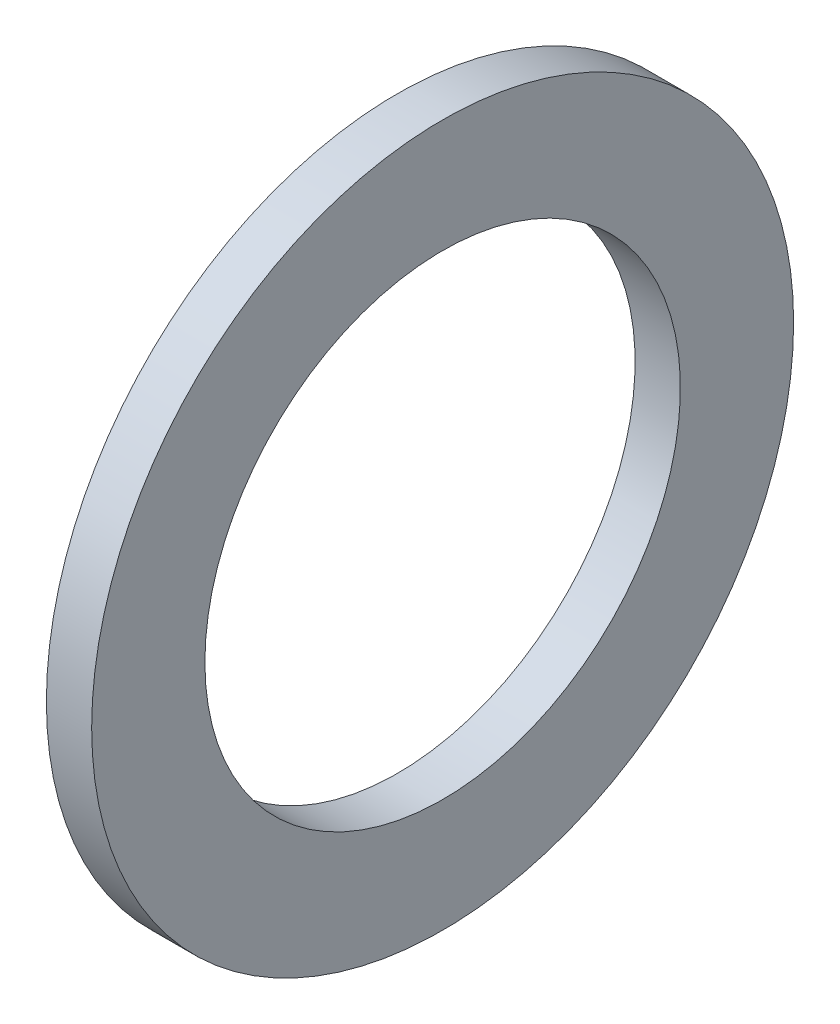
ISO-10303-21;
HEADER;
FILE_DESCRIPTION(('STEP AP214'),'2;1');
FILE_NAME('part.step','',(''),(''),'','','');
FILE_SCHEMA(('AUTOMOTIVE_DESIGN { 1 0 10303 214 1 1 1 1 }'));
ENDSEC;
DATA;
#1=APPLICATION_CONTEXT('core data for automotive mechanical design processes');
#2=APPLICATION_PROTOCOL_DEFINITION('international standard','automotive_design',2000,#1);
#3=PRODUCT_CONTEXT('',#1,'mechanical');
#4=PRODUCT('Part','Part','',(#3));
#5=PRODUCT_RELATED_PRODUCT_CATEGORY('part','',(#4));
#6=PRODUCT_DEFINITION_FORMATION('','',#4);
#7=PRODUCT_DEFINITION_CONTEXT('part definition',#1,'design');
#8=PRODUCT_DEFINITION('design','',#6,#7);
#9=PRODUCT_DEFINITION_SHAPE('','',#8);
#10=(LENGTH_UNIT() NAMED_UNIT(*) SI_UNIT(.MILLI.,.METRE.));
#11=(NAMED_UNIT(*) PLANE_ANGLE_UNIT() SI_UNIT($,.RADIAN.));
#12=(NAMED_UNIT(*) SI_UNIT($,.STERADIAN.) SOLID_ANGLE_UNIT());
#13=UNCERTAINTY_MEASURE_WITH_UNIT(LENGTH_MEASURE(1.E-05),#10,'distance_accuracy_value','');
#14=(GEOMETRIC_REPRESENTATION_CONTEXT(3) GLOBAL_UNCERTAINTY_ASSIGNED_CONTEXT((#13)) GLOBAL_UNIT_ASSIGNED_CONTEXT((#10,
#11,#12)) REPRESENTATION_CONTEXT('',''));
#15=CARTESIAN_POINT('',(0.,0.,0.));
#16=DIRECTION('',(0.,0.,1.));
#17=DIRECTION('',(1.,0.,0.));
#18=AXIS2_PLACEMENT_3D('',#15,#16,#17);
#19=CARTESIAN_POINT('',(-34.9249999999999,0.,0.));
#20=DIRECTION('',(-1.,0.,0.));
#21=DIRECTION('',(0.,0.,1.));
#22=AXIS2_PLACEMENT_3D('',#19,#20,#21);
#23=CYLINDRICAL_SURFACE('',#22,10.5);
#24=CARTESIAN_POINT('',(0.,0.,0.));
#25=DIRECTION('',(-1.,0.,0.));
#26=DIRECTION('',(0.,0.,1.));
#27=AXIS2_PLACEMENT_3D('',#24,#25,#26);
#28=CIRCLE('',#27,10.5);
#29=CARTESIAN_POINT('',(0.,0.,10.5));
#30=VERTEX_POINT('',#29);
#31=EDGE_CURVE('E10',#30,#30,#28,.T.);
#32=ORIENTED_EDGE('',*,*,#31,.F.);
#33=EDGE_LOOP('',(#32));
#34=FACE_BOUND('',#33,.T.);
#35=CARTESIAN_POINT('',(-2.,0.,0.));
#36=DIRECTION('',(-1.,0.,0.));
#37=DIRECTION('',(0.,0.,1.));
#38=AXIS2_PLACEMENT_3D('',#35,#36,#37);
#39=CIRCLE('',#38,10.5);
#40=CARTESIAN_POINT('',(-2.,0.,10.5));
#41=VERTEX_POINT('',#40);
#42=EDGE_CURVE('E51',#41,#41,#39,.T.);
#43=ORIENTED_EDGE('',*,*,#42,.T.);
#44=EDGE_LOOP('',(#43));
#45=FACE_BOUND('',#44,.T.);
#46=ADVANCED_FACE('F37',(#34,#45),#23,.F.);
#47=CARTESIAN_POINT('',(0.,10.5,0.));
#48=DIRECTION('',(-1.,0.,0.));
#49=DIRECTION('',(0.,0.,1.));
#50=AXIS2_PLACEMENT_3D('',#47,#48,#49);
#51=PLANE('',#50);
#52=CARTESIAN_POINT('',(0.,0.,0.));
#53=DIRECTION('',(-1.,0.,0.));
#54=DIRECTION('',(0.,0.,1.));
#55=AXIS2_PLACEMENT_3D('',#52,#53,#54);
#56=CIRCLE('',#55,15.5);
#57=CARTESIAN_POINT('',(0.,0.,15.5));
#58=VERTEX_POINT('',#57);
#59=EDGE_CURVE('E43',#58,#58,#56,.T.);
#60=ORIENTED_EDGE('',*,*,#59,.F.);
#61=EDGE_LOOP('',(#60));
#62=FACE_BOUND('',#61,.T.);
#63=ORIENTED_EDGE('',*,*,#31,.T.);
#64=EDGE_LOOP('',(#63));
#65=FACE_BOUND('',#64,.T.);
#66=ADVANCED_FACE('F66',(#62,#65),#51,.F.);
#67=CARTESIAN_POINT('',(-34.9249999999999,0.,0.));
#68=DIRECTION('',(-1.,0.,0.));
#69=DIRECTION('',(0.,0.,1.));
#70=AXIS2_PLACEMENT_3D('',#67,#68,#69);
#71=CYLINDRICAL_SURFACE('',#70,15.5);
#72=CARTESIAN_POINT('',(-2.,0.,0.));
#73=DIRECTION('',(-1.,0.,0.));
#74=DIRECTION('',(0.,0.,1.));
#75=AXIS2_PLACEMENT_3D('',#72,#73,#74);
#76=CIRCLE('',#75,15.5);
#77=CARTESIAN_POINT('',(-2.,0.,15.5));
#78=VERTEX_POINT('',#77);
#79=EDGE_CURVE('E47',#78,#78,#76,.T.);
#80=ORIENTED_EDGE('',*,*,#79,.F.);
#81=EDGE_LOOP('',(#80));
#82=FACE_BOUND('',#81,.T.);
#83=ORIENTED_EDGE('',*,*,#59,.T.);
#84=EDGE_LOOP('',(#83));
#85=FACE_BOUND('',#84,.T.);
#86=ADVANCED_FACE('F61',(#82,#85),#71,.T.);
#87=CARTESIAN_POINT('',(-2.,15.5,0.));
#88=DIRECTION('',(1.,0.,0.));
#89=DIRECTION('',(0.,0.,-1.));
#90=AXIS2_PLACEMENT_3D('',#87,#88,#89);
#91=PLANE('',#90);
#92=ORIENTED_EDGE('',*,*,#42,.F.);
#93=EDGE_LOOP('',(#92));
#94=FACE_BOUND('',#93,.T.);
#95=ORIENTED_EDGE('',*,*,#79,.T.);
#96=EDGE_LOOP('',(#95));
#97=FACE_BOUND('',#96,.T.);
#98=ADVANCED_FACE('F58',(#94,#97),#91,.F.);
#99=CLOSED_SHELL('',(#46,#66,#86,#98));
#100=MANIFOLD_SOLID_BREP('B2',#99);
#101=ADVANCED_BREP_SHAPE_REPRESENTATION('',(#18,#100),#14);
#102=SHAPE_DEFINITION_REPRESENTATION(#9,#101);
ENDSEC;
END-ISO-10303-21;
